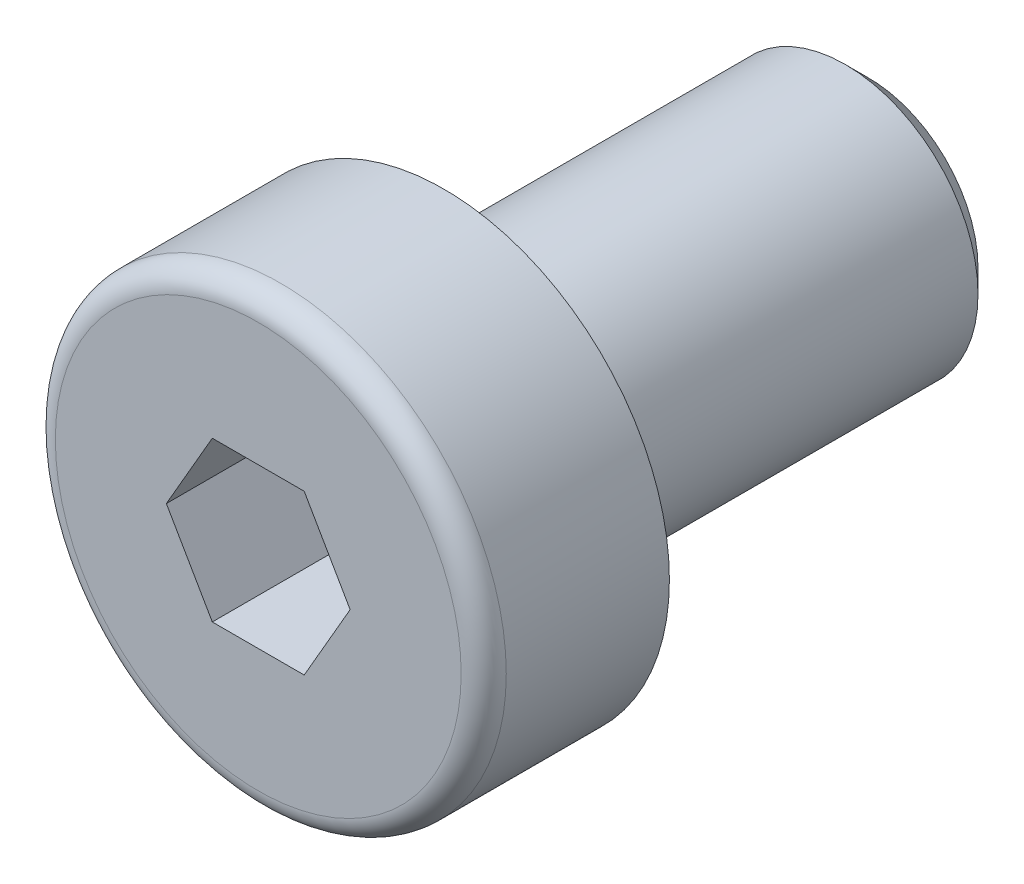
ISO-10303-21;
HEADER;
FILE_DESCRIPTION(('STEP AP214'),'2;1');
FILE_NAME('part.step','',(''),(''),'','','');
FILE_SCHEMA(('AUTOMOTIVE_DESIGN { 1 0 10303 214 1 1 1 1 }'));
ENDSEC;
DATA;
#1=APPLICATION_CONTEXT('core data for automotive mechanical design processes');
#2=APPLICATION_PROTOCOL_DEFINITION('international standard','automotive_design',2000,#1);
#3=PRODUCT_CONTEXT('',#1,'mechanical');
#4=PRODUCT('Part','Part','',(#3));
#5=PRODUCT_RELATED_PRODUCT_CATEGORY('part','',(#4));
#6=PRODUCT_DEFINITION_FORMATION('','',#4);
#7=PRODUCT_DEFINITION_CONTEXT('part definition',#1,'design');
#8=PRODUCT_DEFINITION('design','',#6,#7);
#9=PRODUCT_DEFINITION_SHAPE('','',#8);
#10=(LENGTH_UNIT() NAMED_UNIT(*) SI_UNIT(.MILLI.,.METRE.));
#11=(NAMED_UNIT(*) PLANE_ANGLE_UNIT() SI_UNIT($,.RADIAN.));
#12=(NAMED_UNIT(*) SI_UNIT($,.STERADIAN.) SOLID_ANGLE_UNIT());
#13=UNCERTAINTY_MEASURE_WITH_UNIT(LENGTH_MEASURE(1.E-05),#10,'distance_accuracy_value','');
#14=(GEOMETRIC_REPRESENTATION_CONTEXT(3) GLOBAL_UNCERTAINTY_ASSIGNED_CONTEXT((#13)) GLOBAL_UNIT_ASSIGNED_CONTEXT((#10,
#11,#12)) REPRESENTATION_CONTEXT('',''));
#15=CARTESIAN_POINT('',(0.,0.,0.));
#16=DIRECTION('',(0.,0.,1.));
#17=DIRECTION('',(1.,0.,0.));
#18=AXIS2_PLACEMENT_3D('',#15,#16,#17);
#19=CARTESIAN_POINT('',(0.,0.,3.5));
#20=DIRECTION('',(0.,0.,1.));
#21=DIRECTION('',(1.,0.,0.));
#22=AXIS2_PLACEMENT_3D('',#19,#20,#21);
#23=CYLINDRICAL_SURFACE('',#22,2.5);
#24=CARTESIAN_POINT('',(0.,0.,-0.25));
#25=DIRECTION('',(0.,0.,1.));
#26=DIRECTION('',(1.,0.,0.));
#27=AXIS2_PLACEMENT_3D('',#24,#25,#26);
#28=CIRCLE('',#27,2.5);
#29=CARTESIAN_POINT('',(2.5,0.,-0.25));
#30=VERTEX_POINT('',#29);
#31=EDGE_CURVE('E134',#30,#30,#28,.T.);
#32=ORIENTED_EDGE('',*,*,#31,.F.);
#33=EDGE_LOOP('',(#32));
#34=FACE_BOUND('',#33,.T.);
#35=CARTESIAN_POINT('',(0.,0.,-0.255));
#36=DIRECTION('',(0.,0.,1.));
#37=DIRECTION('',(1.,0.,0.));
#38=AXIS2_PLACEMENT_3D('',#35,#36,#37);
#39=CIRCLE('',#38,2.5);
#40=CARTESIAN_POINT('',(2.5,0.,-0.255));
#41=VERTEX_POINT('',#40);
#42=EDGE_CURVE('E281',#41,#41,#39,.T.);
#43=ORIENTED_EDGE('',*,*,#42,.T.);
#44=EDGE_LOOP('',(#43));
#45=FACE_BOUND('',#44,.T.);
#46=ADVANCED_FACE('F15',(#34,#45),#23,.T.);
#47=CARTESIAN_POINT('',(0.,0.,3.5));
#48=DIRECTION('',(0.,0.,1.));
#49=DIRECTION('',(1.,0.,0.));
#50=AXIS2_PLACEMENT_3D('',#47,#48,#49);
#51=PLANE('',#50);
#52=CARTESIAN_POINT('',(0.,0.,3.5));
#53=DIRECTION('',(0.,0.,1.));
#54=DIRECTION('',(1.,0.,0.));
#55=AXIS2_PLACEMENT_3D('',#52,#53,#54);
#56=CIRCLE('',#55,3.825);
#57=CARTESIAN_POINT('',(3.825,0.,3.5));
#58=VERTEX_POINT('',#57);
#59=EDGE_CURVE('E118',#58,#58,#56,.T.);
#60=ORIENTED_EDGE('',*,*,#59,.T.);
#61=EDGE_LOOP('',(#60));
#62=FACE_BOUND('',#61,.T.);
#63=DIRECTION('',(1.,0.,0.));
#64=VECTOR('',#63,1.);
#65=CARTESIAN_POINT('',(-0.866025,1.49999930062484,3.5));
#66=LINE('',#65,#64);
#67=CARTESIAN_POINT('',(-0.866025,1.49999930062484,3.5));
#68=VERTEX_POINT('',#67);
#69=CARTESIAN_POINT('',(0.866025,1.49999930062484,3.5));
#70=VERTEX_POINT('',#69);
#71=EDGE_CURVE('E95',#68,#70,#66,.T.);
#72=ORIENTED_EDGE('',*,*,#71,.T.);
#73=DIRECTION('',(0.5,-0.866025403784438,0.));
#74=VECTOR('',#73,1.);
#75=CARTESIAN_POINT('',(0.866025,1.49999930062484,3.5));
#76=LINE('',#75,#74);
#77=CARTESIAN_POINT('',(1.73205,0.,3.5));
#78=VERTEX_POINT('',#77);
#79=EDGE_CURVE('E31',#70,#78,#76,.T.);
#80=ORIENTED_EDGE('',*,*,#79,.T.);
#81=DIRECTION('',(-0.5,-0.866025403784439,0.));
#82=VECTOR('',#81,1.);
#83=CARTESIAN_POINT('',(1.73205,0.,3.5));
#84=LINE('',#83,#82);
#85=CARTESIAN_POINT('',(0.866025,-1.49999930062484,3.5));
#86=VERTEX_POINT('',#85);
#87=EDGE_CURVE('E199',#78,#86,#84,.T.);
#88=ORIENTED_EDGE('',*,*,#87,.T.);
#89=DIRECTION('',(-1.,0.,0.));
#90=VECTOR('',#89,1.);
#91=CARTESIAN_POINT('',(0.866025,-1.49999930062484,3.5));
#92=LINE('',#91,#90);
#93=CARTESIAN_POINT('',(-0.866025,-1.49999930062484,3.5));
#94=VERTEX_POINT('',#93);
#95=EDGE_CURVE('E258',#86,#94,#92,.T.);
#96=ORIENTED_EDGE('',*,*,#95,.T.);
#97=DIRECTION('',(-0.5,0.866025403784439,0.));
#98=VECTOR('',#97,1.);
#99=CARTESIAN_POINT('',(-0.866025,-1.49999930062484,3.5));
#100=LINE('',#99,#98);
#101=CARTESIAN_POINT('',(-1.73205,0.,3.5));
#102=VERTEX_POINT('',#101);
#103=EDGE_CURVE('E252',#94,#102,#100,.T.);
#104=ORIENTED_EDGE('',*,*,#103,.T.);
#105=DIRECTION('',(0.5,0.866025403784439,0.));
#106=VECTOR('',#105,1.);
#107=CARTESIAN_POINT('',(-1.73205,0.,3.5));
#108=LINE('',#107,#106);
#109=EDGE_CURVE('E104',#102,#68,#108,.T.);
#110=ORIENTED_EDGE('',*,*,#109,.T.);
#111=EDGE_LOOP('',(#72,#80,#88,#96,#104,#110));
#112=FACE_BOUND('',#111,.T.);
#113=ADVANCED_FACE('F158',(#62,#112),#51,.T.);
#114=CARTESIAN_POINT('',(0.,0.,-0.25));
#115=DIRECTION('',(0.,0.,1.));
#116=DIRECTION('',(1.,0.,0.));
#117=AXIS2_PLACEMENT_3D('',#114,#115,#116);
#118=TOROIDAL_SURFACE('',#117,2.75,0.25);
#119=ORIENTED_EDGE('',*,*,#31,.T.);
#120=EDGE_LOOP('',(#119));
#121=FACE_BOUND('',#120,.T.);
#122=CARTESIAN_POINT('',(0.,0.,0.));
#123=DIRECTION('',(0.,0.,1.));
#124=DIRECTION('',(1.,0.,0.));
#125=AXIS2_PLACEMENT_3D('',#122,#123,#124);
#126=CIRCLE('',#125,2.75);
#127=CARTESIAN_POINT('',(2.75,0.,0.));
#128=VERTEX_POINT('',#127);
#129=EDGE_CURVE('E130',#128,#128,#126,.T.);
#130=ORIENTED_EDGE('',*,*,#129,.F.);
#131=EDGE_LOOP('',(#130));
#132=FACE_BOUND('',#131,.T.);
#133=ADVANCED_FACE('F163',(#121,#132),#118,.F.);
#134=CARTESIAN_POINT('',(0.,4.25,0.));
#135=DIRECTION('',(0.,0.,-1.));
#136=DIRECTION('',(-1.,0.,0.));
#137=AXIS2_PLACEMENT_3D('',#134,#135,#136);
#138=PLANE('',#137);
#139=ORIENTED_EDGE('',*,*,#129,.T.);
#140=EDGE_LOOP('',(#139));
#141=FACE_BOUND('',#140,.T.);
#142=CARTESIAN_POINT('',(0.,0.,0.));
#143=DIRECTION('',(0.,0.,1.));
#144=DIRECTION('',(1.,0.,0.));
#145=AXIS2_PLACEMENT_3D('',#142,#143,#144);
#146=CIRCLE('',#145,4.25);
#147=CARTESIAN_POINT('',(4.25,0.,0.));
#148=VERTEX_POINT('',#147);
#149=EDGE_CURVE('E126',#148,#148,#146,.T.);
#150=ORIENTED_EDGE('',*,*,#149,.F.);
#151=EDGE_LOOP('',(#150));
#152=FACE_BOUND('',#151,.T.);
#153=ADVANCED_FACE('F171',(#141,#152),#138,.T.);
#154=CARTESIAN_POINT('',(0.,0.,3.5));
#155=DIRECTION('',(0.,0.,1.));
#156=DIRECTION('',(1.,0.,0.));
#157=AXIS2_PLACEMENT_3D('',#154,#155,#156);
#158=CYLINDRICAL_SURFACE('',#157,4.25);
#159=ORIENTED_EDGE('',*,*,#149,.T.);
#160=EDGE_LOOP('',(#159));
#161=FACE_BOUND('',#160,.T.);
#162=CARTESIAN_POINT('',(0.,0.,3.075));
#163=DIRECTION('',(0.,0.,1.));
#164=DIRECTION('',(1.,0.,0.));
#165=AXIS2_PLACEMENT_3D('',#162,#163,#164);
#166=CIRCLE('',#165,4.25);
#167=CARTESIAN_POINT('',(4.25,0.,3.075));
#168=VERTEX_POINT('',#167);
#169=EDGE_CURVE('E122',#168,#168,#166,.T.);
#170=ORIENTED_EDGE('',*,*,#169,.F.);
#171=EDGE_LOOP('',(#170));
#172=FACE_BOUND('',#171,.T.);
#173=ADVANCED_FACE('F175',(#161,#172),#158,.T.);
#174=CARTESIAN_POINT('',(0.,0.,3.075));
#175=DIRECTION('',(0.,0.,1.));
#176=DIRECTION('',(1.,0.,0.));
#177=AXIS2_PLACEMENT_3D('',#174,#175,#176);
#178=TOROIDAL_SURFACE('',#177,3.825,0.425);
#179=ORIENTED_EDGE('',*,*,#59,.F.);
#180=EDGE_LOOP('',(#179));
#181=FACE_BOUND('',#180,.T.);
#182=ORIENTED_EDGE('',*,*,#169,.T.);
#183=EDGE_LOOP('',(#182));
#184=FACE_BOUND('',#183,.T.);
#185=ADVANCED_FACE('F179',(#181,#184),#178,.T.);
#186=CARTESIAN_POINT('',(0.866025,1.49999930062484,-0.199999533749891));
#187=DIRECTION('',(-0.866025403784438,-0.5,0.));
#188=DIRECTION('',(-0.5,0.866025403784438,0.));
#189=AXIS2_PLACEMENT_3D('',#186,#187,#188);
#190=PLANE('',#189);
#191=DIRECTION('',(0.,0.,1.));
#192=VECTOR('',#191,1.);
#193=CARTESIAN_POINT('',(1.73205,0.,-0.199999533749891));
#194=LINE('',#193,#192);
#195=CARTESIAN_POINT('',(1.73205,0.,0.8));
#196=VERTEX_POINT('',#195);
#197=EDGE_CURVE('E116',#196,#78,#194,.T.);
#198=ORIENTED_EDGE('',*,*,#197,.T.);
#199=ORIENTED_EDGE('',*,*,#79,.F.);
#200=DIRECTION('',(0.,0.,1.));
#201=VECTOR('',#200,1.);
#202=CARTESIAN_POINT('',(0.866025,1.49999930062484,-0.199999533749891));
#203=LINE('',#202,#201);
#204=CARTESIAN_POINT('',(0.866025,1.49999930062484,0.8));
#205=VERTEX_POINT('',#204);
#206=EDGE_CURVE('E88',#205,#70,#203,.T.);
#207=ORIENTED_EDGE('',*,*,#206,.F.);
#208=CARTESIAN_POINT('',(1.73205115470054,-2.E-06,0.800000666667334));
#209=CARTESIAN_POINT('',(1.69399458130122,0.0659139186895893,0.778022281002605));
#210=CARTESIAN_POINT('',(1.65560950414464,0.132398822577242,0.758034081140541));
#211=CARTESIAN_POINT('',(1.57817473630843,0.266519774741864,0.723145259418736));
#212=CARTESIAN_POINT('',(1.53912367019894,0.334158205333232,0.708256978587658));
#213=CARTESIAN_POINT('',(1.46150547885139,0.468596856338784,0.685082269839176));
#214=CARTESIAN_POINT('',(1.42295029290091,0.535376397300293,0.676641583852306));
#215=CARTESIAN_POINT('',(1.34565859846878,0.669249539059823,0.66656700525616));
#216=CARTESIAN_POINT('',(1.30692237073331,0.736342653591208,0.664924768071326));
#217=CARTESIAN_POINT('',(1.23454773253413,0.861699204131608,0.668349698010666));
#218=CARTESIAN_POINT('',(1.20089846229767,0.919981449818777,0.672575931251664));
#219=CARTESIAN_POINT('',(1.1338191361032,1.03616625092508,0.685967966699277));
#220=CARTESIAN_POINT('',(1.10038931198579,1.09406840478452,0.69513833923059));
#221=CARTESIAN_POINT('',(1.03317179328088,1.21049256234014,0.718062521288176));
#222=CARTESIAN_POINT('',(0.999392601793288,1.26899983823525,0.731913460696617));
#223=CARTESIAN_POINT('',(0.932337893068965,1.38514200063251,0.763349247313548));
#224=CARTESIAN_POINT('',(0.89906151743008,1.4427783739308,0.780926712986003));
#225=CARTESIAN_POINT('',(0.866023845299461,1.50000130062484,0.800000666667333));
#226=B_SPLINE_CURVE_WITH_KNOTS('',3,(#208,#209,#210,#211,#212,#213,#214,#215,#216,#217,#218,
#219,#220,#221,#222,#223,#224,#225),.UNSPECIFIED.,.F.,.F.,(4,2,2,2,2,2,2,2,4),(0.,
0.237762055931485,0.476095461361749,0.708530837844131,0.94068083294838,1.14278193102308,
1.34507017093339,1.55184422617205,1.75821246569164),.UNSPECIFIED.);
#227=EDGE_CURVE('E80',#196,#205,#226,.T.);
#228=ORIENTED_EDGE('',*,*,#227,.F.);
#229=EDGE_LOOP('',(#198,#199,#207,#228));
#230=FACE_BOUND('',#229,.T.);
#231=ADVANCED_FACE('F89',(#230),#190,.T.);
#232=CARTESIAN_POINT('',(1.73205,0.,-0.199999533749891));
#233=DIRECTION('',(-0.866025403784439,0.5,0.));
#234=DIRECTION('',(0.5,0.866025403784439,0.));
#235=AXIS2_PLACEMENT_3D('',#232,#233,#234);
#236=PLANE('',#235);
#237=DIRECTION('',(0.,0.,1.));
#238=VECTOR('',#237,1.);
#239=CARTESIAN_POINT('',(0.866025,-1.49999930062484,-0.199999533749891));
#240=LINE('',#239,#238);
#241=CARTESIAN_POINT('',(0.866025,-1.49999930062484,0.8));
#242=VERTEX_POINT('',#241);
#243=EDGE_CURVE('E113',#242,#86,#240,.T.);
#244=ORIENTED_EDGE('',*,*,#243,.T.);
#245=ORIENTED_EDGE('',*,*,#87,.F.);
#246=ORIENTED_EDGE('',*,*,#197,.F.);
#247=CARTESIAN_POINT('',(0.866023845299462,-1.50000130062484,0.800000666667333));
#248=CARTESIAN_POINT('',(0.904080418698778,-1.43408538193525,0.778022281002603));
#249=CARTESIAN_POINT('',(0.942465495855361,-1.36760047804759,0.758034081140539));
#250=CARTESIAN_POINT('',(1.01990026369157,-1.23347952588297,0.723145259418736));
#251=CARTESIAN_POINT('',(1.05895132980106,-1.1658410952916,0.708256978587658));
#252=CARTESIAN_POINT('',(1.13656952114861,-1.03140244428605,0.685082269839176));
#253=CARTESIAN_POINT('',(1.1751247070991,-0.964622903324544,0.676641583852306));
#254=CARTESIAN_POINT('',(1.25241640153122,-0.830749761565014,0.66656700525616));
#255=CARTESIAN_POINT('',(1.29115262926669,-0.763656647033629,0.664924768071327));
#256=CARTESIAN_POINT('',(1.36352726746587,-0.638300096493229,0.668349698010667));
#257=CARTESIAN_POINT('',(1.39717653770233,-0.58001785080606,0.672575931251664));
#258=CARTESIAN_POINT('',(1.4642558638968,-0.463833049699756,0.685967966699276));
#259=CARTESIAN_POINT('',(1.49768568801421,-0.405930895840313,0.695138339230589));
#260=CARTESIAN_POINT('',(1.56490320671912,-0.2895067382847,0.718062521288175));
#261=CARTESIAN_POINT('',(1.59868239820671,-0.230999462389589,0.731913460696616));
#262=CARTESIAN_POINT('',(1.66573710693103,-0.114857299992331,0.763349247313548));
#263=CARTESIAN_POINT('',(1.69901348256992,-0.0572209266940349,0.780926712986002));
#264=CARTESIAN_POINT('',(1.73205115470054,1.99999999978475E-06,0.800000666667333));
#265=B_SPLINE_CURVE_WITH_KNOTS('',3,(#247,#248,#249,#250,#251,#252,#253,#254,#255,#256,#257,
#258,#259,#260,#261,#262,#263,#264),.UNSPECIFIED.,.F.,.F.,(4,2,2,2,2,2,2,2,4),(0.,
0.237762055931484,0.476095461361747,0.708530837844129,0.940680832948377,1.14278193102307,
1.34507017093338,1.55184422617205,1.75821246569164),.UNSPECIFIED.);
#266=EDGE_CURVE('E84',#242,#196,#265,.T.);
#267=ORIENTED_EDGE('',*,*,#266,.F.);
#268=EDGE_LOOP('',(#244,#245,#246,#267));
#269=FACE_BOUND('',#268,.T.);
#270=ADVANCED_FACE('F187',(#269),#236,.T.);
#271=CARTESIAN_POINT('',(0.866025,-1.49999930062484,-0.199999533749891));
#272=DIRECTION('',(0.,1.,0.));
#273=DIRECTION('',(1.,0.,0.));
#274=AXIS2_PLACEMENT_3D('',#271,#272,#273);
#275=PLANE('',#274);
#276=DIRECTION('',(0.,0.,1.));
#277=VECTOR('',#276,1.);
#278=CARTESIAN_POINT('',(-0.866025,-1.49999930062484,-0.199999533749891));
#279=LINE('',#278,#277);
#280=CARTESIAN_POINT('',(-0.866025,-1.49999930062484,0.8));
#281=VERTEX_POINT('',#280);
#282=EDGE_CURVE('E110',#281,#94,#279,.T.);
#283=ORIENTED_EDGE('',*,*,#282,.T.);
#284=ORIENTED_EDGE('',*,*,#95,.F.);
#285=ORIENTED_EDGE('',*,*,#243,.F.);
#286=CARTESIAN_POINT('',(-2.24271663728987,-1.49999930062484,1.35775267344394));
#287=CARTESIAN_POINT('',(-2.17794141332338,-1.49999930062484,1.32667596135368));
#288=CARTESIAN_POINT('',(-2.11300852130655,-1.49999930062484,1.29592211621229));
#289=CARTESIAN_POINT('',(-1.98274303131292,-1.49999930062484,1.23524311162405));
#290=CARTESIAN_POINT('',(-1.91741036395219,-1.49999930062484,1.20531810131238));
#291=CARTESIAN_POINT('',(-1.78588635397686,-1.49999930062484,1.14631254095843));
#292=CARTESIAN_POINT('',(-1.71969220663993,-1.49999930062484,1.11723821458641));
#293=CARTESIAN_POINT('',(-1.58674953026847,-1.49999930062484,1.06039396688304));
#294=CARTESIAN_POINT('',(-1.52000103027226,-1.49999930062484,1.03262397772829));
#295=CARTESIAN_POINT('',(-1.38408036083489,-1.49999930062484,0.978025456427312));
#296=CARTESIAN_POINT('',(-1.31489044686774,-1.49999930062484,0.951240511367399));
#297=CARTESIAN_POINT('',(-1.17568875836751,-1.49999930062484,0.89990652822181));
#298=CARTESIAN_POINT('',(-1.10567688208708,-1.49999930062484,0.875357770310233));
#299=CARTESIAN_POINT('',(-0.894522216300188,-1.49999930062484,0.806101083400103));
#300=CARTESIAN_POINT('',(-0.751873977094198,-1.49999930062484,0.7656202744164));
#301=CARTESIAN_POINT('',(-0.535047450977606,-1.49999930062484,0.718664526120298));
#302=CARTESIAN_POINT('',(-0.462365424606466,-1.49999930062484,0.705312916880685));
#303=CARTESIAN_POINT('',(-0.316183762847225,-1.49999930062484,0.684113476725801));
#304=CARTESIAN_POINT('',(-0.242684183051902,-1.49999930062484,0.676265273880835));
#305=CARTESIAN_POINT('',(-0.0961588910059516,-1.49999930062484,0.666798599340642));
#306=CARTESIAN_POINT('',(-0.0231380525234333,-1.49999930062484,0.665106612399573));
#307=CARTESIAN_POINT('',(0.122783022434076,-1.49999930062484,0.667899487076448));
#308=CARTESIAN_POINT('',(0.195683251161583,-1.49999930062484,0.672384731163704));
#309=CARTESIAN_POINT('',(0.375553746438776,-1.49999930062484,0.690677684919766));
#310=CARTESIAN_POINT('',(0.482175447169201,-1.49999930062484,0.707913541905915));
#311=CARTESIAN_POINT('',(0.693345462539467,-1.49999930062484,0.752359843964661));
#312=CARTESIAN_POINT('',(0.797891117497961,-1.49999930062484,0.779582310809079));
#313=CARTESIAN_POINT('',(0.954250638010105,-1.49999930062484,0.826084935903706));
#314=CARTESIAN_POINT('',(1.00687274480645,-1.49999930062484,0.842747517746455));
#315=CARTESIAN_POINT('',(1.11156919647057,-1.49999930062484,0.877614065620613));
#316=CARTESIAN_POINT('',(1.16364386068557,-1.49999930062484,0.895817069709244));
#317=CARTESIAN_POINT('',(1.26731501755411,-1.49999930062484,0.933500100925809));
#318=CARTESIAN_POINT('',(1.31891159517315,-1.49999930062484,0.952979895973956));
#319=CARTESIAN_POINT('',(1.42169818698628,-1.49999930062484,0.993005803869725));
#320=CARTESIAN_POINT('',(1.47288813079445,-1.49999930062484,1.01355209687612));
#321=CARTESIAN_POINT('',(1.6035520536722,-1.49999930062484,1.06731329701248));
#322=CARTESIAN_POINT('',(1.68276476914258,-1.49999930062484,1.10116251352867));
#323=CARTESIAN_POINT('',(1.84047488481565,-1.49999930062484,1.17049266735));
#324=CARTESIAN_POINT('',(1.9189722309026,-1.49999930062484,1.20597372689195));
#325=CARTESIAN_POINT('',(2.15362957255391,-1.49999930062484,1.31428942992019));
#326=CARTESIAN_POINT('',(2.3089286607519,-1.49999930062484,1.38898549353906));
#327=CARTESIAN_POINT('',(2.61820006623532,-1.49999930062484,1.54151036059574));
#328=CARTESIAN_POINT('',(2.77217051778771,-1.49999930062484,1.61934290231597));
#329=CARTESIAN_POINT('',(3.07905650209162,-1.49999930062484,1.77700931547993));
#330=CARTESIAN_POINT('',(3.23197216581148,-1.49999930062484,1.85684293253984));
#331=CARTESIAN_POINT('',(3.52267476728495,-1.49999930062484,2.01028853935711));
#332=CARTESIAN_POINT('',(3.66052737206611,-1.49999930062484,2.08377655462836));
#333=CARTESIAN_POINT('',(3.93578914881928,-1.49999930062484,2.23158990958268));
#334=CARTESIAN_POINT('',(4.07319830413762,-1.49999930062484,2.30591528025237));
#335=CARTESIAN_POINT('',(4.34732590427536,-1.49999930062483,2.45500351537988));
#336=CARTESIAN_POINT('',(4.48404521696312,-1.49999930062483,2.52976478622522));
#337=CARTESIAN_POINT('',(4.75720742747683,-1.49999930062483,2.67977391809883));
#338=CARTESIAN_POINT('',(4.89365033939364,-1.49999930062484,2.7550217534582));
#339=CARTESIAN_POINT('',(5.02999394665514,-1.49999930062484,2.83044801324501));
#340=B_SPLINE_CURVE_WITH_KNOTS('',3,(#286,#287,#288,#289,#290,#291,#292,#293,#294,#295,#296,
#297,#298,#299,#300,#301,#302,#303,#304,#305,#306,#307,#308,#309,#310,#311,#312,#313,#314,#315,
#316,#317,#318,#319,#320,#321,#322,#323,#324,#325,#326,#327,#328,#329,#330,#331,#332,#333,#334,
#335,#336,#337,#338,#339),.UNSPECIFIED.,.F.,.F.,(4,2,2,2,2,2,2,2,2,2,2,2,2,2,2,2,2,2,2,2,2,2,2,
2,2,2,4),(0.,0.215535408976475,0.431109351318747,0.647990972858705,0.864861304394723,
1.08740082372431,1.30996818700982,1.75384735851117,1.97537373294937,2.19688513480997,
2.41574248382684,2.63461338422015,2.95796620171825,3.28170955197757,3.44728283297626,
3.61275347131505,3.77819411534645,3.94366279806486,4.20206179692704,4.46048018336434,
4.97740230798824,5.49495989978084,6.01245202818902,6.48110050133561,6.94976637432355,
7.41724019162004,7.88468954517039),.UNSPECIFIED.);
#341=EDGE_CURVE('E227',#281,#242,#340,.T.);
#342=ORIENTED_EDGE('',*,*,#341,.F.);
#343=EDGE_LOOP('',(#283,#284,#285,#342));
#344=FACE_BOUND('',#343,.T.);
#345=ADVANCED_FACE('F232',(#344),#275,.T.);
#346=CARTESIAN_POINT('',(-0.866025,-1.49999930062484,-0.199999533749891));
#347=DIRECTION('',(0.866025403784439,0.5,0.));
#348=DIRECTION('',(0.5,-0.866025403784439,0.));
#349=AXIS2_PLACEMENT_3D('',#346,#347,#348);
#350=PLANE('',#349);
#351=DIRECTION('',(0.,0.,1.));
#352=VECTOR('',#351,1.);
#353=CARTESIAN_POINT('',(-1.73205,0.,-0.199999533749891));
#354=LINE('',#353,#352);
#355=CARTESIAN_POINT('',(-1.73205,0.,0.8));
#356=VERTEX_POINT('',#355);
#357=EDGE_CURVE('E101',#356,#102,#354,.T.);
#358=ORIENTED_EDGE('',*,*,#357,.T.);
#359=ORIENTED_EDGE('',*,*,#103,.F.);
#360=ORIENTED_EDGE('',*,*,#282,.F.);
#361=CARTESIAN_POINT('',(-1.73205115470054,1.99999999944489E-06,0.800000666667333));
#362=CARTESIAN_POINT('',(-1.69399458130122,-0.0659139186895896,0.778022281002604));
#363=CARTESIAN_POINT('',(-1.65560950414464,-0.132398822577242,0.75803408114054));
#364=CARTESIAN_POINT('',(-1.57817473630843,-0.266519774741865,0.723145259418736));
#365=CARTESIAN_POINT('',(-1.53912367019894,-0.334158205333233,0.708256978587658));
#366=CARTESIAN_POINT('',(-1.46150547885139,-0.468596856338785,0.685082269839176));
#367=CARTESIAN_POINT('',(-1.4229502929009,-0.535376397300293,0.676641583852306));
#368=CARTESIAN_POINT('',(-1.34565859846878,-0.669249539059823,0.66656700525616));
#369=CARTESIAN_POINT('',(-1.30692237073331,-0.736342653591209,0.664924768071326));
#370=CARTESIAN_POINT('',(-1.23454773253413,-0.861699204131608,0.668349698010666));
#371=CARTESIAN_POINT('',(-1.20089846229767,-0.919981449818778,0.672575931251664));
#372=CARTESIAN_POINT('',(-1.1338191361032,-1.03616625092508,0.685967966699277));
#373=CARTESIAN_POINT('',(-1.10038931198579,-1.09406840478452,0.69513833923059));
#374=CARTESIAN_POINT('',(-1.03317179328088,-1.21049256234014,0.718062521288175));
#375=CARTESIAN_POINT('',(-0.999392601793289,-1.26899983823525,0.731913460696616));
#376=CARTESIAN_POINT('',(-0.932337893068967,-1.38514200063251,0.763349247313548));
#377=CARTESIAN_POINT('',(-0.899061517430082,-1.4427783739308,0.780926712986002));
#378=CARTESIAN_POINT('',(-0.866023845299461,-1.50000130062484,0.800000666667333));
#379=B_SPLINE_CURVE_WITH_KNOTS('',3,(#361,#362,#363,#364,#365,#366,#367,#368,#369,#370,#371,
#372,#373,#374,#375,#376,#377,#378),.UNSPECIFIED.,.F.,.F.,(4,2,2,2,2,2,2,2,4),(0.,
0.237762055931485,0.476095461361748,0.708530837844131,0.94068083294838,1.14278193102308,
1.34507017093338,1.55184422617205,1.75821246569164),.UNSPECIFIED.);
#380=EDGE_CURVE('E222',#356,#281,#379,.T.);
#381=ORIENTED_EDGE('',*,*,#380,.F.);
#382=EDGE_LOOP('',(#358,#359,#360,#381));
#383=FACE_BOUND('',#382,.T.);
#384=ADVANCED_FACE('F235',(#383),#350,.T.);
#385=CARTESIAN_POINT('',(-1.73205,0.,-0.199999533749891));
#386=DIRECTION('',(0.866025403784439,-0.5,0.));
#387=DIRECTION('',(-0.5,-0.866025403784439,0.));
#388=AXIS2_PLACEMENT_3D('',#385,#386,#387);
#389=PLANE('',#388);
#390=DIRECTION('',(0.,0.,1.));
#391=VECTOR('',#390,1.);
#392=CARTESIAN_POINT('',(-0.866025,1.49999930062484,-0.199999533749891));
#393=LINE('',#392,#391);
#394=CARTESIAN_POINT('',(-0.866025,1.49999930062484,0.8));
#395=VERTEX_POINT('',#394);
#396=EDGE_CURVE('E94',#395,#68,#393,.T.);
#397=ORIENTED_EDGE('',*,*,#396,.T.);
#398=ORIENTED_EDGE('',*,*,#109,.F.);
#399=ORIENTED_EDGE('',*,*,#357,.F.);
#400=CARTESIAN_POINT('',(-0.866023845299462,1.50000130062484,0.800000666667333));
#401=CARTESIAN_POINT('',(-0.904080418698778,1.43408538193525,0.778022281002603));
#402=CARTESIAN_POINT('',(-0.942465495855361,1.36760047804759,0.75803408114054));
#403=CARTESIAN_POINT('',(-1.01990026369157,1.23347952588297,0.723145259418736));
#404=CARTESIAN_POINT('',(-1.05895132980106,1.1658410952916,0.708256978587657));
#405=CARTESIAN_POINT('',(-1.13656952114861,1.03140244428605,0.685082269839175));
#406=CARTESIAN_POINT('',(-1.1751247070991,0.964622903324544,0.676641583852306));
#407=CARTESIAN_POINT('',(-1.25241640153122,0.830749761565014,0.66656700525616));
#408=CARTESIAN_POINT('',(-1.29115262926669,0.763656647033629,0.664924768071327));
#409=CARTESIAN_POINT('',(-1.36352726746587,0.638300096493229,0.668349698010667));
#410=CARTESIAN_POINT('',(-1.39717653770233,0.58001785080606,0.672575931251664));
#411=CARTESIAN_POINT('',(-1.4642558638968,0.463833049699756,0.685967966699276));
#412=CARTESIAN_POINT('',(-1.49768568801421,0.405930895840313,0.695138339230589));
#413=CARTESIAN_POINT('',(-1.56490320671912,0.289506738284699,0.718062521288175));
#414=CARTESIAN_POINT('',(-1.59868239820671,0.230999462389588,0.731913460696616));
#415=CARTESIAN_POINT('',(-1.66573710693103,0.11485729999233,0.763349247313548));
#416=CARTESIAN_POINT('',(-1.69901348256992,0.0572209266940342,0.780926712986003));
#417=CARTESIAN_POINT('',(-1.73205115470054,-2.00000000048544E-06,0.800000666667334));
#418=B_SPLINE_CURVE_WITH_KNOTS('',3,(#400,#401,#402,#403,#404,#405,#406,#407,#408,#409,#410,
#411,#412,#413,#414,#415,#416,#417),.UNSPECIFIED.,.F.,.F.,(4,2,2,2,2,2,2,2,4),(0.,
0.237762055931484,0.476095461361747,0.708530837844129,0.940680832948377,1.14278193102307,
1.34507017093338,1.55184422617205,1.75821246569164),.UNSPECIFIED.);
#419=EDGE_CURVE('E39',#395,#356,#418,.T.);
#420=ORIENTED_EDGE('',*,*,#419,.F.);
#421=EDGE_LOOP('',(#397,#398,#399,#420));
#422=FACE_BOUND('',#421,.T.);
#423=ADVANCED_FACE('F239',(#422),#389,.T.);
#424=CARTESIAN_POINT('',(-0.866025,1.49999930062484,-0.199999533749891));
#425=DIRECTION('',(0.,-1.,0.));
#426=DIRECTION('',(-1.,0.,0.));
#427=AXIS2_PLACEMENT_3D('',#424,#425,#426);
#428=PLANE('',#427);
#429=ORIENTED_EDGE('',*,*,#206,.T.);
#430=ORIENTED_EDGE('',*,*,#71,.F.);
#431=ORIENTED_EDGE('',*,*,#396,.F.);
#432=CARTESIAN_POINT('',(-2.24271663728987,1.49999930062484,1.35775267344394));
#433=CARTESIAN_POINT('',(-2.17794141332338,1.49999930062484,1.32667596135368));
#434=CARTESIAN_POINT('',(-2.11300852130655,1.49999930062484,1.29592211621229));
#435=CARTESIAN_POINT('',(-1.98274303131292,1.49999930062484,1.23524311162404));
#436=CARTESIAN_POINT('',(-1.91741036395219,1.49999930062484,1.20531810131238));
#437=CARTESIAN_POINT('',(-1.78588635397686,1.49999930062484,1.14631254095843));
#438=CARTESIAN_POINT('',(-1.71969220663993,1.49999930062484,1.11723821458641));
#439=CARTESIAN_POINT('',(-1.58674953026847,1.49999930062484,1.06039396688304));
#440=CARTESIAN_POINT('',(-1.52000103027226,1.49999930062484,1.03262397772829));
#441=CARTESIAN_POINT('',(-1.3840803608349,1.49999930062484,0.978025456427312));
#442=CARTESIAN_POINT('',(-1.31489044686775,1.49999930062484,0.951240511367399));
#443=CARTESIAN_POINT('',(-1.17568875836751,1.49999930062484,0.89990652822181));
#444=CARTESIAN_POINT('',(-1.10567688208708,1.49999930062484,0.875357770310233));
#445=CARTESIAN_POINT('',(-0.89452221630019,1.49999930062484,0.806101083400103));
#446=CARTESIAN_POINT('',(-0.7518739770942,1.49999930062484,0.7656202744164));
#447=CARTESIAN_POINT('',(-0.535047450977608,1.49999930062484,0.718664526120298));
#448=CARTESIAN_POINT('',(-0.462365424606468,1.49999930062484,0.705312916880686));
#449=CARTESIAN_POINT('',(-0.316183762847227,1.49999930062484,0.684113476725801));
#450=CARTESIAN_POINT('',(-0.242684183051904,1.49999930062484,0.676265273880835));
#451=CARTESIAN_POINT('',(-0.0961588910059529,1.49999930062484,0.666798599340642));
#452=CARTESIAN_POINT('',(-0.0231380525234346,1.49999930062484,0.665106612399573));
#453=CARTESIAN_POINT('',(0.122783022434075,1.49999930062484,0.667899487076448));
#454=CARTESIAN_POINT('',(0.195683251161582,1.49999930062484,0.672384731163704));
#455=CARTESIAN_POINT('',(0.375553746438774,1.49999930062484,0.690677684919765));
#456=CARTESIAN_POINT('',(0.4821754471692,1.49999930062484,0.707913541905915));
#457=CARTESIAN_POINT('',(0.693345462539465,1.49999930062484,0.752359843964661));
#458=CARTESIAN_POINT('',(0.797891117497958,1.49999930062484,0.779582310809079));
#459=CARTESIAN_POINT('',(0.954250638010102,1.49999930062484,0.826084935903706));
#460=CARTESIAN_POINT('',(1.00687274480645,1.49999930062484,0.842747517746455));
#461=CARTESIAN_POINT('',(1.11156919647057,1.49999930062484,0.877614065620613));
#462=CARTESIAN_POINT('',(1.16364386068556,1.49999930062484,0.895817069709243));
#463=CARTESIAN_POINT('',(1.2673150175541,1.49999930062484,0.933500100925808));
#464=CARTESIAN_POINT('',(1.31891159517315,1.49999930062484,0.952979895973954));
#465=CARTESIAN_POINT('',(1.42169818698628,1.49999930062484,0.993005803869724));
#466=CARTESIAN_POINT('',(1.47288813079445,1.49999930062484,1.01355209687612));
#467=CARTESIAN_POINT('',(1.60355205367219,1.49999930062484,1.06731329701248));
#468=CARTESIAN_POINT('',(1.68276476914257,1.49999930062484,1.10116251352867));
#469=CARTESIAN_POINT('',(1.84047488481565,1.49999930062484,1.17049266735));
#470=CARTESIAN_POINT('',(1.91897223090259,1.49999930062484,1.20597372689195));
#471=CARTESIAN_POINT('',(2.15362957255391,1.49999930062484,1.31428942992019));
#472=CARTESIAN_POINT('',(2.30892866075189,1.49999930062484,1.38898549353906));
#473=CARTESIAN_POINT('',(2.61820006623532,1.49999930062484,1.54151036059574));
#474=CARTESIAN_POINT('',(2.77217051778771,1.49999930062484,1.61934290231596));
#475=CARTESIAN_POINT('',(3.07905650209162,1.49999930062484,1.77700931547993));
#476=CARTESIAN_POINT('',(3.23197216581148,1.49999930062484,1.85684293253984));
#477=CARTESIAN_POINT('',(3.52267476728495,1.49999930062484,2.01028853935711));
#478=CARTESIAN_POINT('',(3.66052737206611,1.49999930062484,2.08377655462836));
#479=CARTESIAN_POINT('',(3.93578914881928,1.49999930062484,2.23158990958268));
#480=CARTESIAN_POINT('',(4.07319830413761,1.49999930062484,2.30591528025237));
#481=CARTESIAN_POINT('',(4.34732590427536,1.49999930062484,2.45500351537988));
#482=CARTESIAN_POINT('',(4.48404521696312,1.49999930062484,2.52976478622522));
#483=CARTESIAN_POINT('',(4.75720742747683,1.49999930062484,2.67977391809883));
#484=CARTESIAN_POINT('',(4.89365033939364,1.49999930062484,2.7550217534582));
#485=CARTESIAN_POINT('',(5.02999394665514,1.49999930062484,2.83044801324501));
#486=B_SPLINE_CURVE_WITH_KNOTS('',3,(#432,#433,#434,#435,#436,#437,#438,#439,#440,#441,#442,
#443,#444,#445,#446,#447,#448,#449,#450,#451,#452,#453,#454,#455,#456,#457,#458,#459,#460,#461,
#462,#463,#464,#465,#466,#467,#468,#469,#470,#471,#472,#473,#474,#475,#476,#477,#478,#479,#480,
#481,#482,#483,#484,#485),.UNSPECIFIED.,.F.,.F.,(4,2,2,2,2,2,2,2,2,2,2,2,2,2,2,2,2,2,2,2,2,2,2,
2,2,2,4),(0.,0.215535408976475,0.431109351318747,0.647990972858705,0.864861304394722,
1.0874008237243,1.30996818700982,1.75384735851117,1.97537373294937,2.19688513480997,
2.41574248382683,2.63461338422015,2.95796620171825,3.28170955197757,3.44728283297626,
3.61275347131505,3.77819411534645,3.94366279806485,4.20206179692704,4.46048018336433,
4.97740230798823,5.49495989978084,6.01245202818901,6.48110050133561,6.94976637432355,
7.41724019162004,7.88468954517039),.UNSPECIFIED.);
#487=EDGE_CURVE('E81',#205,#395,#486,.F.);
#488=ORIENTED_EDGE('',*,*,#487,.F.);
#489=EDGE_LOOP('',(#429,#430,#431,#488));
#490=FACE_BOUND('',#489,.T.);
#491=ADVANCED_FACE('F76',(#490),#428,.T.);
#492=CARTESIAN_POINT('',(0.,0.,-0.199999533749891));
#493=DIRECTION('',(0.,0.,1.));
#494=DIRECTION('',(1.,0.,0.));
#495=AXIS2_PLACEMENT_3D('',#492,#493,#494);
#496=CONICAL_SURFACE('',#495,0.,1.0471975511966);
#497=CARTESIAN_POINT('',(0.,0.,-0.199999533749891));
#498=VERTEX_POINT('',#497);
#499=VERTEX_LOOP('',#498);
#500=FACE_BOUND('',#499,.T.);
#501=ORIENTED_EDGE('',*,*,#227,.T.);
#502=ORIENTED_EDGE('',*,*,#487,.T.);
#503=ORIENTED_EDGE('',*,*,#419,.T.);
#504=ORIENTED_EDGE('',*,*,#380,.T.);
#505=ORIENTED_EDGE('',*,*,#341,.T.);
#506=ORIENTED_EDGE('',*,*,#266,.T.);
#507=EDGE_LOOP('',(#501,#502,#503,#504,#505,#506));
#508=FACE_BOUND('',#507,.T.);
#509=ADVANCED_FACE('F72',(#500,#508),#496,.F.);
#510=CARTESIAN_POINT('',(0.,0.,-0.255));
#511=DIRECTION('',(0.,0.,1.));
#512=DIRECTION('',(1.,0.,0.));
#513=AXIS2_PLACEMENT_3D('',#510,#511,#512);
#514=CONICAL_SURFACE('',#513,2.5,0.523598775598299);
#515=CARTESIAN_POINT('',(0.,0.,-1.00497799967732));
#516=DIRECTION('',(0.,0.,1.));
#517=DIRECTION('',(1.,0.,0.));
#518=AXIS2_PLACEMENT_3D('',#515,#516,#517);
#519=CIRCLE('',#518,2.067);
#520=CARTESIAN_POINT('',(2.067,0.,-1.00497799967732));
#521=VERTEX_POINT('',#520);
#522=EDGE_CURVE('E284',#521,#521,#519,.T.);
#523=ORIENTED_EDGE('',*,*,#522,.T.);
#524=EDGE_LOOP('',(#523));
#525=FACE_BOUND('',#524,.T.);
#526=ORIENTED_EDGE('',*,*,#42,.F.);
#527=EDGE_LOOP('',(#526));
#528=FACE_BOUND('',#527,.T.);
#529=ADVANCED_FACE('F75',(#525,#528),#514,.T.);
#530=CARTESIAN_POINT('',(0.,2.067,-1.00497799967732));
#531=DIRECTION('',(0.,0.,1.));
#532=DIRECTION('',(1.,0.,0.));
#533=AXIS2_PLACEMENT_3D('',#530,#531,#532);
#534=PLANE('',#533);
#535=CARTESIAN_POINT('',(0.,0.,-1.00497799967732));
#536=DIRECTION('',(0.,0.,1.));
#537=DIRECTION('',(1.,0.,0.));
#538=AXIS2_PLACEMENT_3D('',#535,#536,#537);
#539=CIRCLE('',#538,2.5);
#540=CARTESIAN_POINT('',(2.5,0.,-1.00497799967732));
#541=VERTEX_POINT('',#540);
#542=EDGE_CURVE('E415',#541,#541,#539,.T.);
#543=ORIENTED_EDGE('',*,*,#542,.T.);
#544=EDGE_LOOP('',(#543));
#545=FACE_BOUND('',#544,.T.);
#546=ORIENTED_EDGE('',*,*,#522,.F.);
#547=EDGE_LOOP('',(#546));
#548=FACE_BOUND('',#547,.T.);
#549=ADVANCED_FACE('F155',(#545,#548),#534,.T.);
#550=CARTESIAN_POINT('',(0.,2.067,-8.));
#551=DIRECTION('',(0.,0.,-1.));
#552=DIRECTION('',(-1.,0.,0.));
#553=AXIS2_PLACEMENT_3D('',#550,#551,#552);
#554=PLANE('',#553);
#555=CARTESIAN_POINT('',(0.,0.,-8.));
#556=DIRECTION('',(0.,0.,1.));
#557=DIRECTION('',(1.,0.,0.));
#558=AXIS2_PLACEMENT_3D('',#555,#556,#557);
#559=CIRCLE('',#558,2.067);
#560=CARTESIAN_POINT('',(2.067,0.,-8.));
#561=VERTEX_POINT('',#560);
#562=EDGE_CURVE('E9',#561,#561,#559,.T.);
#563=ORIENTED_EDGE('',*,*,#562,.F.);
#564=EDGE_LOOP('',(#563));
#565=FACE_BOUND('',#564,.T.);
#566=ADVANCED_FACE('F17',(#565),#554,.T.);
#567=CARTESIAN_POINT('',(0.,0.,-7.567));
#568=DIRECTION('',(0.,0.,1.));
#569=DIRECTION('',(1.,0.,0.));
#570=AXIS2_PLACEMENT_3D('',#567,#568,#569);
#571=CONICAL_SURFACE('',#570,2.5,0.785398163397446);
#572=ORIENTED_EDGE('',*,*,#562,.T.);
#573=EDGE_LOOP('',(#572));
#574=FACE_BOUND('',#573,.T.);
#575=CARTESIAN_POINT('',(0.,0.,-7.567));
#576=DIRECTION('',(0.,0.,1.));
#577=DIRECTION('',(1.,0.,0.));
#578=AXIS2_PLACEMENT_3D('',#575,#576,#577);
#579=CIRCLE('',#578,2.5);
#580=CARTESIAN_POINT('',(2.5,0.,-7.567));
#581=VERTEX_POINT('',#580);
#582=EDGE_CURVE('E24',#581,#581,#579,.T.);
#583=ORIENTED_EDGE('',*,*,#582,.F.);
#584=EDGE_LOOP('',(#583));
#585=FACE_BOUND('',#584,.T.);
#586=ADVANCED_FACE('F146',(#574,#585),#571,.T.);
#587=ORIENTED_EDGE('',*,*,#582,.T.);
#588=EDGE_LOOP('',(#587));
#589=FACE_BOUND('',#588,.T.);
#590=ORIENTED_EDGE('',*,*,#542,.F.);
#591=EDGE_LOOP('',(#590));
#592=FACE_BOUND('',#591,.T.);
#593=ADVANCED_FACE('F143',(#589,#592),#23,.T.);
#594=CLOSED_SHELL('',(#46,#113,#133,#153,#173,#185,#231,#270,#345,#384,#423,#491,#509,#529,#549,
#566,#586,#593));
#595=MANIFOLD_SOLID_BREP('B1',#594);
#596=ADVANCED_BREP_SHAPE_REPRESENTATION('',(#18,#595),#14);
#597=SHAPE_DEFINITION_REPRESENTATION(#9,#596);
ENDSEC;
END-ISO-10303-21;
